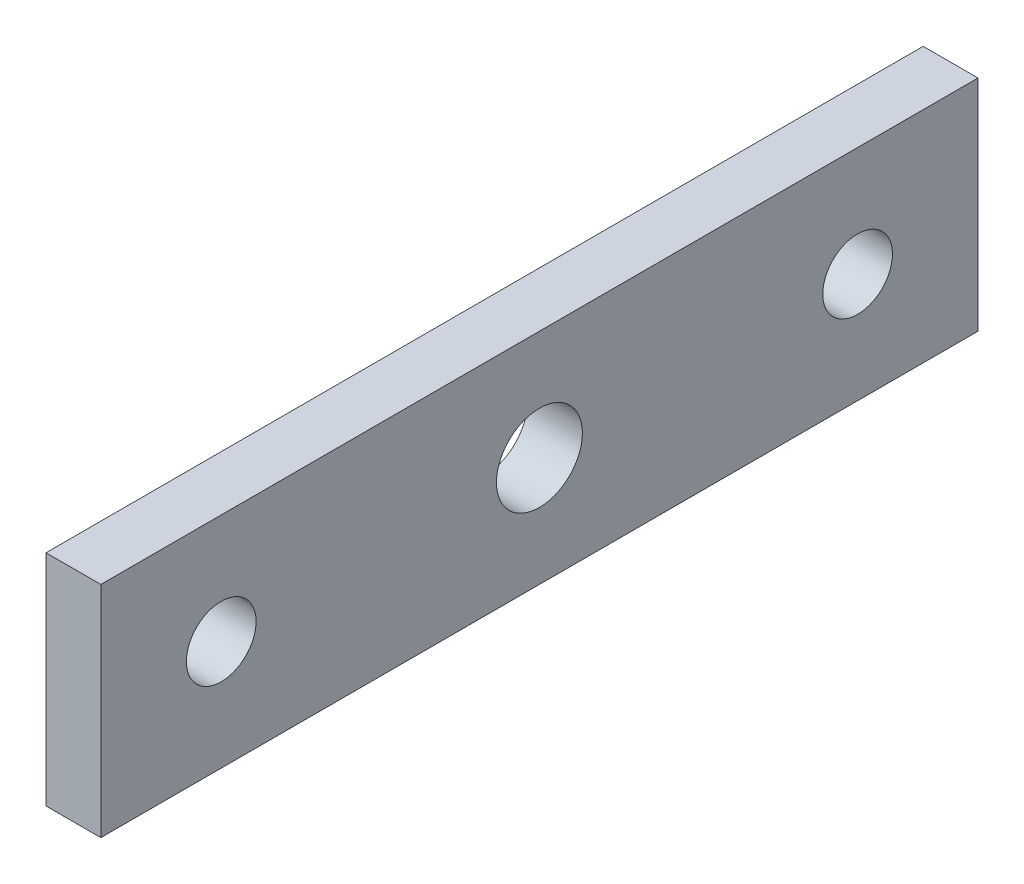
ISO-10303-21;
HEADER;
FILE_DESCRIPTION(('STEP AP214'),'2;1');
FILE_NAME('part.step','',(''),(''),'','','');
FILE_SCHEMA(('AUTOMOTIVE_DESIGN { 1 0 10303 214 1 1 1 1 }'));
ENDSEC;
DATA;
#1=APPLICATION_CONTEXT('core data for automotive mechanical design processes');
#2=APPLICATION_PROTOCOL_DEFINITION('international standard','automotive_design',2000,#1);
#3=PRODUCT_CONTEXT('',#1,'mechanical');
#4=PRODUCT('Part','Part','',(#3));
#5=PRODUCT_RELATED_PRODUCT_CATEGORY('part','',(#4));
#6=PRODUCT_DEFINITION_FORMATION('','',#4);
#7=PRODUCT_DEFINITION_CONTEXT('part definition',#1,'design');
#8=PRODUCT_DEFINITION('design','',#6,#7);
#9=PRODUCT_DEFINITION_SHAPE('','',#8);
#10=(LENGTH_UNIT() NAMED_UNIT(*) SI_UNIT(.MILLI.,.METRE.));
#11=(NAMED_UNIT(*) PLANE_ANGLE_UNIT() SI_UNIT($,.RADIAN.));
#12=(NAMED_UNIT(*) SI_UNIT($,.STERADIAN.) SOLID_ANGLE_UNIT());
#13=UNCERTAINTY_MEASURE_WITH_UNIT(LENGTH_MEASURE(1.E-05),#10,'distance_accuracy_value','');
#14=(GEOMETRIC_REPRESENTATION_CONTEXT(3) GLOBAL_UNCERTAINTY_ASSIGNED_CONTEXT((#13)) GLOBAL_UNIT_ASSIGNED_CONTEXT((#10,
#11,#12)) REPRESENTATION_CONTEXT('',''));
#15=CARTESIAN_POINT('',(0.,0.,0.));
#16=DIRECTION('',(0.,0.,1.));
#17=DIRECTION('',(1.,0.,0.));
#18=AXIS2_PLACEMENT_3D('',#15,#16,#17);
#19=CARTESIAN_POINT('',(3.175,0.,0.));
#20=DIRECTION('',(1.,0.,0.));
#21=DIRECTION('',(0.,0.,-1.));
#22=AXIS2_PLACEMENT_3D('',#19,#20,#21);
#23=PLANE('',#22);
#24=CARTESIAN_POINT('',(3.175,-6.35,-43.8277000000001));
#25=DIRECTION('',(1.,0.,0.));
#26=DIRECTION('',(0.,0.,-1.));
#27=AXIS2_PLACEMENT_3D('',#24,#25,#26);
#28=CIRCLE('',#27,2.0193);
#29=CARTESIAN_POINT('',(3.175,-6.35,-45.8470000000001));
#30=VERTEX_POINT('',#29);
#31=EDGE_CURVE('E115',#30,#30,#28,.T.);
#32=ORIENTED_EDGE('',*,*,#31,.F.);
#33=EDGE_LOOP('',(#32));
#34=FACE_BOUND('',#33,.T.);
#35=DIRECTION('',(0.,-1.,0.));
#36=VECTOR('',#35,1.);
#37=CARTESIAN_POINT('',(3.175,0.,0.));
#38=LINE('',#37,#36);
#39=CARTESIAN_POINT('',(3.175,0.,0.));
#40=VERTEX_POINT('',#39);
#41=CARTESIAN_POINT('',(3.175,-12.7,0.));
#42=VERTEX_POINT('',#41);
#43=EDGE_CURVE('E85',#40,#42,#38,.T.);
#44=ORIENTED_EDGE('',*,*,#43,.T.);
#45=DIRECTION('',(0.,0.,-1.));
#46=VECTOR('',#45,1.);
#47=CARTESIAN_POINT('',(3.175,-12.7,0.));
#48=LINE('',#47,#46);
#49=CARTESIAN_POINT('',(3.175,-12.7,-50.8));
#50=VERTEX_POINT('',#49);
#51=EDGE_CURVE('E80',#42,#50,#48,.T.);
#52=ORIENTED_EDGE('',*,*,#51,.T.);
#53=DIRECTION('',(0.,1.,0.));
#54=VECTOR('',#53,1.);
#55=CARTESIAN_POINT('',(3.175,0.,-50.8));
#56=LINE('',#55,#54);
#57=CARTESIAN_POINT('',(3.175,0.,-50.8));
#58=VERTEX_POINT('',#57);
#59=EDGE_CURVE('E83',#50,#58,#56,.T.);
#60=ORIENTED_EDGE('',*,*,#59,.T.);
#61=DIRECTION('',(0.,0.,1.));
#62=VECTOR('',#61,1.);
#63=CARTESIAN_POINT('',(3.175,0.,0.));
#64=LINE('',#63,#62);
#65=EDGE_CURVE('E50',#58,#40,#64,.T.);
#66=ORIENTED_EDGE('',*,*,#65,.T.);
#67=EDGE_LOOP('',(#44,#52,#60,#66));
#68=FACE_BOUND('',#67,.T.);
#69=CARTESIAN_POINT('',(3.175,-6.35,-6.9723000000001));
#70=DIRECTION('',(1.,0.,0.));
#71=DIRECTION('',(0.,0.,-1.));
#72=AXIS2_PLACEMENT_3D('',#69,#70,#71);
#73=CIRCLE('',#72,2.0193);
#74=CARTESIAN_POINT('',(3.175,-6.35,-8.9916000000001));
#75=VERTEX_POINT('',#74);
#76=EDGE_CURVE('E100',#75,#75,#73,.T.);
#77=ORIENTED_EDGE('',*,*,#76,.F.);
#78=EDGE_LOOP('',(#77));
#79=FACE_BOUND('',#78,.T.);
#80=CARTESIAN_POINT('',(3.175,-6.35,-25.4000000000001));
#81=DIRECTION('',(1.,0.,0.));
#82=DIRECTION('',(0.,0.,-1.));
#83=AXIS2_PLACEMENT_3D('',#80,#81,#82);
#84=CIRCLE('',#83,2.4892);
#85=CARTESIAN_POINT('',(3.175,-6.35,-27.8892000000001));
#86=VERTEX_POINT('',#85);
#87=EDGE_CURVE('E121',#86,#86,#84,.T.);
#88=ORIENTED_EDGE('',*,*,#87,.F.);
#89=EDGE_LOOP('',(#88));
#90=FACE_BOUND('',#89,.T.);
#91=ADVANCED_FACE('F33',(#34,#68,#79,#90),#23,.T.);
#92=CARTESIAN_POINT('',(0.,0.,0.));
#93=DIRECTION('',(1.,0.,0.));
#94=DIRECTION('',(0.,0.,-1.));
#95=AXIS2_PLACEMENT_3D('',#92,#93,#94);
#96=PLANE('',#95);
#97=DIRECTION('',(0.,-1.,0.));
#98=VECTOR('',#97,1.);
#99=CARTESIAN_POINT('',(0.,0.,0.));
#100=LINE('',#99,#98);
#101=CARTESIAN_POINT('',(0.,0.,0.));
#102=VERTEX_POINT('',#101);
#103=CARTESIAN_POINT('',(0.,-12.7,0.));
#104=VERTEX_POINT('',#103);
#105=EDGE_CURVE('E97',#102,#104,#100,.T.);
#106=ORIENTED_EDGE('',*,*,#105,.F.);
#107=DIRECTION('',(0.,0.,1.));
#108=VECTOR('',#107,1.);
#109=CARTESIAN_POINT('',(0.,0.,0.));
#110=LINE('',#109,#108);
#111=CARTESIAN_POINT('',(0.,0.,-50.8));
#112=VERTEX_POINT('',#111);
#113=EDGE_CURVE('E73',#112,#102,#110,.T.);
#114=ORIENTED_EDGE('',*,*,#113,.F.);
#115=DIRECTION('',(0.,1.,0.));
#116=VECTOR('',#115,1.);
#117=CARTESIAN_POINT('',(0.,0.,-50.8));
#118=LINE('',#117,#116);
#119=CARTESIAN_POINT('',(0.,-12.7,-50.8));
#120=VERTEX_POINT('',#119);
#121=EDGE_CURVE('E67',#120,#112,#118,.T.);
#122=ORIENTED_EDGE('',*,*,#121,.F.);
#123=DIRECTION('',(0.,0.,-1.));
#124=VECTOR('',#123,1.);
#125=CARTESIAN_POINT('',(0.,-12.7,0.));
#126=LINE('',#125,#124);
#127=EDGE_CURVE('E89',#104,#120,#126,.T.);
#128=ORIENTED_EDGE('',*,*,#127,.F.);
#129=EDGE_LOOP('',(#106,#114,#122,#128));
#130=FACE_BOUND('',#129,.T.);
#131=CARTESIAN_POINT('',(0.,-6.35,-6.9723000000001));
#132=DIRECTION('',(1.,0.,0.));
#133=DIRECTION('',(0.,0.,-1.));
#134=AXIS2_PLACEMENT_3D('',#131,#132,#133);
#135=CIRCLE('',#134,2.0193);
#136=CARTESIAN_POINT('',(0.,-6.35,-8.9916000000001));
#137=VERTEX_POINT('',#136);
#138=EDGE_CURVE('E112',#137,#137,#135,.T.);
#139=ORIENTED_EDGE('',*,*,#138,.T.);
#140=EDGE_LOOP('',(#139));
#141=FACE_BOUND('',#140,.T.);
#142=CARTESIAN_POINT('',(0.,-6.35,-43.8277000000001));
#143=DIRECTION('',(1.,0.,0.));
#144=DIRECTION('',(0.,0.,-1.));
#145=AXIS2_PLACEMENT_3D('',#142,#143,#144);
#146=CIRCLE('',#145,2.0193);
#147=CARTESIAN_POINT('',(0.,-6.35,-45.8470000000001));
#148=VERTEX_POINT('',#147);
#149=EDGE_CURVE('E118',#148,#148,#146,.T.);
#150=ORIENTED_EDGE('',*,*,#149,.T.);
#151=EDGE_LOOP('',(#150));
#152=FACE_BOUND('',#151,.T.);
#153=CARTESIAN_POINT('',(0.,-6.35,-25.4000000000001));
#154=DIRECTION('',(1.,0.,0.));
#155=DIRECTION('',(0.,0.,-1.));
#156=AXIS2_PLACEMENT_3D('',#153,#154,#155);
#157=CIRCLE('',#156,2.4892);
#158=CARTESIAN_POINT('',(0.,-6.35,-27.8892000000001));
#159=VERTEX_POINT('',#158);
#160=EDGE_CURVE('E124',#159,#159,#157,.T.);
#161=ORIENTED_EDGE('',*,*,#160,.T.);
#162=EDGE_LOOP('',(#161));
#163=FACE_BOUND('',#162,.T.);
#164=ADVANCED_FACE('F108',(#130,#141,#152,#163),#96,.F.);
#165=CARTESIAN_POINT('',(3.175,0.,0.));
#166=DIRECTION('',(0.,0.,-1.));
#167=DIRECTION('',(0.,1.,0.));
#168=AXIS2_PLACEMENT_3D('',#165,#166,#167);
#169=PLANE('',#168);
#170=ORIENTED_EDGE('',*,*,#105,.T.);
#171=DIRECTION('',(-1.,0.,0.));
#172=VECTOR('',#171,1.);
#173=CARTESIAN_POINT('',(3.175,-12.7,0.));
#174=LINE('',#173,#172);
#175=EDGE_CURVE('E11',#42,#104,#174,.T.);
#176=ORIENTED_EDGE('',*,*,#175,.F.);
#177=ORIENTED_EDGE('',*,*,#43,.F.);
#178=DIRECTION('',(-1.,0.,0.));
#179=VECTOR('',#178,1.);
#180=CARTESIAN_POINT('',(3.175,0.,0.));
#181=LINE('',#180,#179);
#182=EDGE_CURVE('E93',#40,#102,#181,.T.);
#183=ORIENTED_EDGE('',*,*,#182,.T.);
#184=EDGE_LOOP('',(#170,#176,#177,#183));
#185=FACE_BOUND('',#184,.T.);
#186=ADVANCED_FACE('F35',(#185),#169,.F.);
#187=CARTESIAN_POINT('',(3.175,-12.7,0.));
#188=DIRECTION('',(0.,1.,0.));
#189=DIRECTION('',(0.,0.,1.));
#190=AXIS2_PLACEMENT_3D('',#187,#188,#189);
#191=PLANE('',#190);
#192=ORIENTED_EDGE('',*,*,#127,.T.);
#193=DIRECTION('',(-1.,0.,0.));
#194=VECTOR('',#193,1.);
#195=CARTESIAN_POINT('',(3.175,-12.7,-50.8));
#196=LINE('',#195,#194);
#197=EDGE_CURVE('E42',#50,#120,#196,.T.);
#198=ORIENTED_EDGE('',*,*,#197,.F.);
#199=ORIENTED_EDGE('',*,*,#51,.F.);
#200=ORIENTED_EDGE('',*,*,#175,.T.);
#201=EDGE_LOOP('',(#192,#198,#199,#200));
#202=FACE_BOUND('',#201,.T.);
#203=ADVANCED_FACE('F88',(#202),#191,.F.);
#204=CARTESIAN_POINT('',(3.175,0.,-50.8));
#205=DIRECTION('',(0.,0.,1.));
#206=DIRECTION('',(1.,0.,0.));
#207=AXIS2_PLACEMENT_3D('',#204,#205,#206);
#208=PLANE('',#207);
#209=ORIENTED_EDGE('',*,*,#121,.T.);
#210=DIRECTION('',(-1.,0.,0.));
#211=VECTOR('',#210,1.);
#212=CARTESIAN_POINT('',(3.175,0.,-50.8));
#213=LINE('',#212,#211);
#214=EDGE_CURVE('E90',#58,#112,#213,.T.);
#215=ORIENTED_EDGE('',*,*,#214,.F.);
#216=ORIENTED_EDGE('',*,*,#59,.F.);
#217=ORIENTED_EDGE('',*,*,#197,.T.);
#218=EDGE_LOOP('',(#209,#215,#216,#217));
#219=FACE_BOUND('',#218,.T.);
#220=ADVANCED_FACE('F91',(#219),#208,.F.);
#221=CARTESIAN_POINT('',(3.175,0.,0.));
#222=DIRECTION('',(0.,-1.,0.));
#223=DIRECTION('',(0.,0.,-1.));
#224=AXIS2_PLACEMENT_3D('',#221,#222,#223);
#225=PLANE('',#224);
#226=ORIENTED_EDGE('',*,*,#113,.T.);
#227=ORIENTED_EDGE('',*,*,#182,.F.);
#228=ORIENTED_EDGE('',*,*,#65,.F.);
#229=ORIENTED_EDGE('',*,*,#214,.T.);
#230=EDGE_LOOP('',(#226,#227,#228,#229));
#231=FACE_BOUND('',#230,.T.);
#232=ADVANCED_FACE('F105',(#231),#225,.F.);
#233=CARTESIAN_POINT('',(3.175,-6.35,-6.9723000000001));
#234=DIRECTION('',(-1.,0.,0.));
#235=DIRECTION('',(0.,0.,1.));
#236=AXIS2_PLACEMENT_3D('',#233,#234,#235);
#237=CYLINDRICAL_SURFACE('',#236,2.0193);
#238=ORIENTED_EDGE('',*,*,#76,.T.);
#239=EDGE_LOOP('',(#238));
#240=FACE_BOUND('',#239,.T.);
#241=ORIENTED_EDGE('',*,*,#138,.F.);
#242=EDGE_LOOP('',(#241));
#243=FACE_BOUND('',#242,.T.);
#244=ADVANCED_FACE('F142',(#240,#243),#237,.F.);
#245=CARTESIAN_POINT('',(3.175,-6.35,-43.8277000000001));
#246=DIRECTION('',(-1.,0.,0.));
#247=DIRECTION('',(0.,0.,1.));
#248=AXIS2_PLACEMENT_3D('',#245,#246,#247);
#249=CYLINDRICAL_SURFACE('',#248,2.0193);
#250=ORIENTED_EDGE('',*,*,#31,.T.);
#251=EDGE_LOOP('',(#250));
#252=FACE_BOUND('',#251,.T.);
#253=ORIENTED_EDGE('',*,*,#149,.F.);
#254=EDGE_LOOP('',(#253));
#255=FACE_BOUND('',#254,.T.);
#256=ADVANCED_FACE('F188',(#252,#255),#249,.F.);
#257=CARTESIAN_POINT('',(3.175,-6.35,-25.4000000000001));
#258=DIRECTION('',(-1.,0.,0.));
#259=DIRECTION('',(0.,0.,1.));
#260=AXIS2_PLACEMENT_3D('',#257,#258,#259);
#261=CYLINDRICAL_SURFACE('',#260,2.4892);
#262=ORIENTED_EDGE('',*,*,#87,.T.);
#263=EDGE_LOOP('',(#262));
#264=FACE_BOUND('',#263,.T.);
#265=ORIENTED_EDGE('',*,*,#160,.F.);
#266=EDGE_LOOP('',(#265));
#267=FACE_BOUND('',#266,.T.);
#268=ADVANCED_FACE('F130',(#264,#267),#261,.F.);
#269=CLOSED_SHELL('',(#91,#164,#186,#203,#220,#232,#244,#256,#268));
#270=MANIFOLD_SOLID_BREP('B2',#269);
#271=ADVANCED_BREP_SHAPE_REPRESENTATION('',(#18,#270),#14);
#272=SHAPE_DEFINITION_REPRESENTATION(#9,#271);
ENDSEC;
END-ISO-10303-21;
